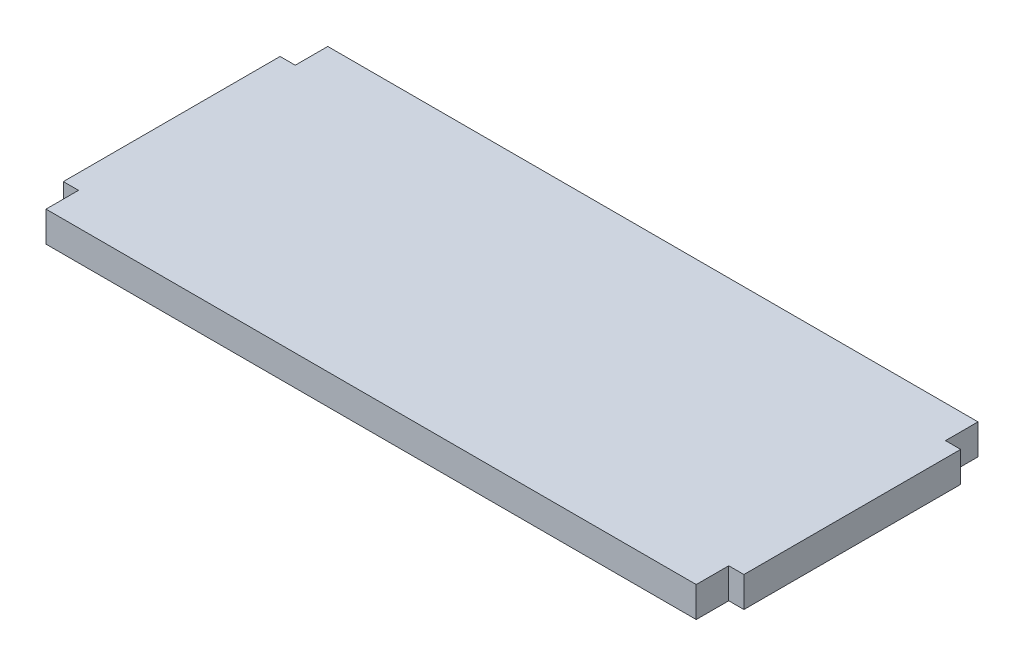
from build123d import *

# Parameters (mm, degrees)
BOSS_EXTRUDE1_DEPTH = 14


with BuildPart() as part:
    # Sketch1 → Boss-Extrude1 (new body)
    with BuildSketch(Plane(origin=(0, 0, 0), x_dir=(1, 0, 0), z_dir=(0, 1, 0))):
        Polygon((0, -115), (7, -115), (7, -130), (307, -130), (307, -115), (314, -115), (314, -15), (307, -15), (307, 0), (7, 0), (7, -15), (0, -15), align=None)
    extrude(amount=BOSS_EXTRUDE1_DEPTH)


solid = part.part
